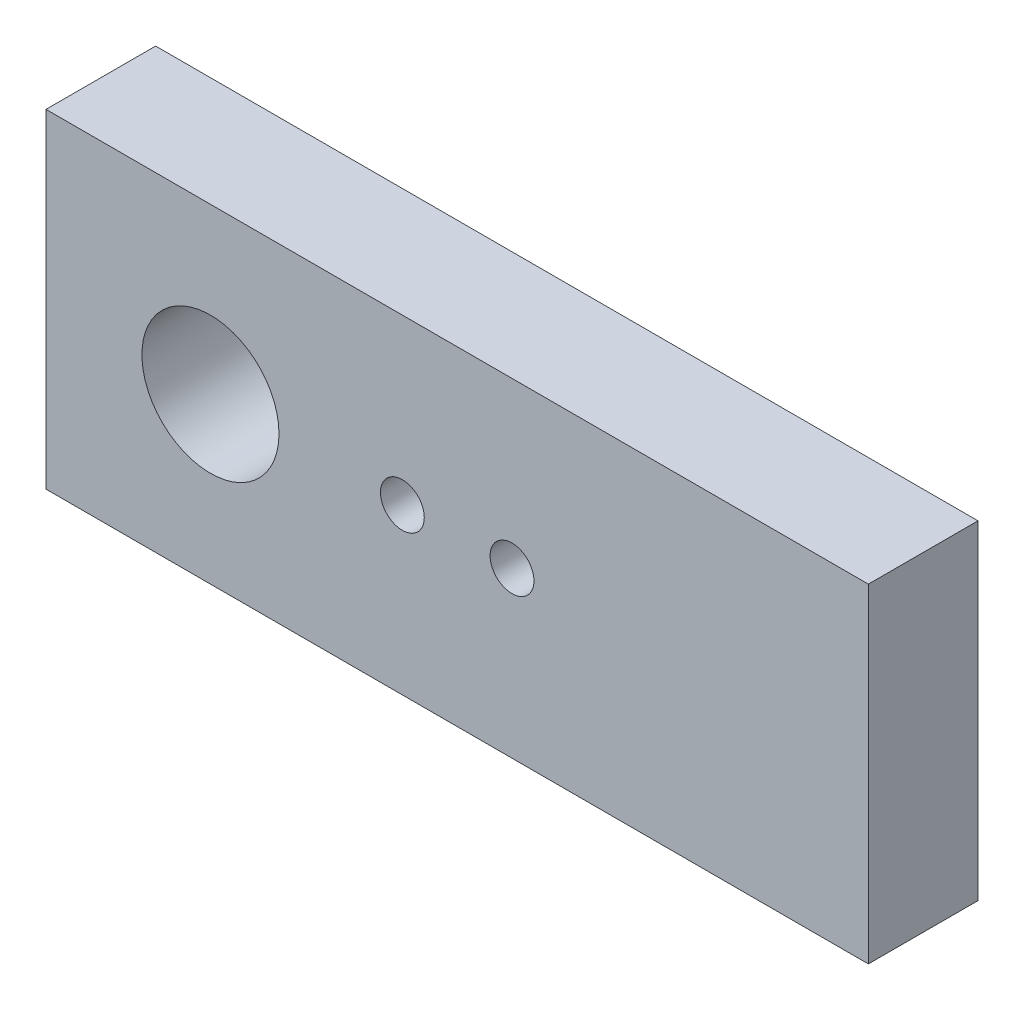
from build123d import *

# Parameters (mm, degrees)
SKETCH_1_W          = 150
SKETCH_1_H          = 60
EXTRUDE_1_DEPTH     = 20
SKETCH_2_R          = 12.5
CUT_EXTRUDE_1_DEPTH = 20
SKETCH_3_R          = 4
CUT_EXTRUDE_2_DEPTH = 20


with BuildPart() as part:
    # Sketch 1 → Extrude 1 (new body)
    with BuildSketch(Plane.XY):
        with Locations((75, 30)):
            Rectangle(SKETCH_1_W, SKETCH_1_H)
    extrude(amount=-EXTRUDE_1_DEPTH)

    # Sketch 2 → Cut-Extrude 1 (cut)
    with BuildSketch(Plane.XY):
        with Locations((30, 30)):
            Circle(SKETCH_2_R)
    extrude(amount=-CUT_EXTRUDE_1_DEPTH, mode=Mode.SUBTRACT)

    # Sketch 3 → Cut-Extrude 2 (cut)
    with BuildSketch(Plane.XY):
        with Locations((65, 30)):
            Circle(SKETCH_3_R)
        with Locations((85, 30)):
            Circle(SKETCH_3_R)
    extrude(amount=-CUT_EXTRUDE_2_DEPTH, mode=Mode.SUBTRACT)


solid = part.part
